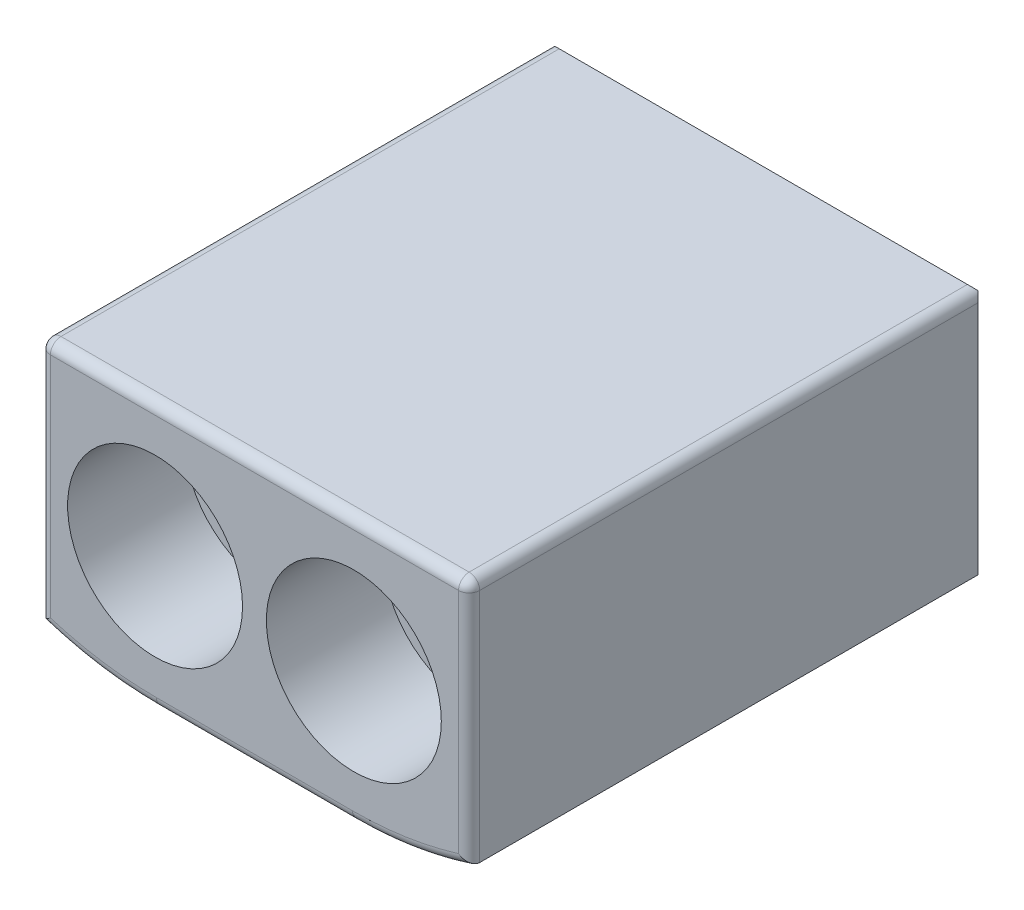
ISO-10303-21;
HEADER;
FILE_DESCRIPTION(('STEP AP214'),'2;1');
FILE_NAME('part.step','',(''),(''),'','','');
FILE_SCHEMA(('AUTOMOTIVE_DESIGN { 1 0 10303 214 1 1 1 1 }'));
ENDSEC;
DATA;
#1=APPLICATION_CONTEXT('core data for automotive mechanical design processes');
#2=APPLICATION_PROTOCOL_DEFINITION('international standard','automotive_design',2000,#1);
#3=PRODUCT_CONTEXT('',#1,'mechanical');
#4=PRODUCT('Part','Part','',(#3));
#5=PRODUCT_RELATED_PRODUCT_CATEGORY('part','',(#4));
#6=PRODUCT_DEFINITION_FORMATION('','',#4);
#7=PRODUCT_DEFINITION_CONTEXT('part definition',#1,'design');
#8=PRODUCT_DEFINITION('design','',#6,#7);
#9=PRODUCT_DEFINITION_SHAPE('','',#8);
#10=(LENGTH_UNIT() NAMED_UNIT(*) SI_UNIT(.MILLI.,.METRE.));
#11=(NAMED_UNIT(*) PLANE_ANGLE_UNIT() SI_UNIT($,.RADIAN.));
#12=(NAMED_UNIT(*) SI_UNIT($,.STERADIAN.) SOLID_ANGLE_UNIT());
#13=UNCERTAINTY_MEASURE_WITH_UNIT(LENGTH_MEASURE(1.E-05),#10,'distance_accuracy_value','');
#14=(GEOMETRIC_REPRESENTATION_CONTEXT(3) GLOBAL_UNCERTAINTY_ASSIGNED_CONTEXT((#13)) GLOBAL_UNIT_ASSIGNED_CONTEXT((#10,
#11,#12)) REPRESENTATION_CONTEXT('',''));
#15=CARTESIAN_POINT('',(0.,0.,0.));
#16=DIRECTION('',(0.,0.,1.));
#17=DIRECTION('',(1.,0.,0.));
#18=AXIS2_PLACEMENT_3D('',#15,#16,#17);
#19=CARTESIAN_POINT('',(-4.7625,-6.35,-25.4));
#20=DIRECTION('',(0.,0.,1.));
#21=DIRECTION('',(1.,0.,0.));
#22=AXIS2_PLACEMENT_3D('',#19,#20,#21);
#23=CYLINDRICAL_SURFACE('',#22,2.794);
#24=CARTESIAN_POINT('',(-4.7625,-6.35,-25.4));
#25=DIRECTION('',(0.,0.,1.));
#26=DIRECTION('',(1.,0.,0.));
#27=AXIS2_PLACEMENT_3D('',#24,#25,#26);
#28=CIRCLE('',#27,2.794);
#29=CARTESIAN_POINT('',(-1.9685,-6.35,-25.4));
#30=VERTEX_POINT('',#29);
#31=EDGE_CURVE('E387',#30,#30,#28,.T.);
#32=ORIENTED_EDGE('',*,*,#31,.F.);
#33=EDGE_LOOP('',(#32));
#34=FACE_BOUND('',#33,.T.);
#35=CARTESIAN_POINT('',(-4.7625,-6.35,-5.588));
#36=DIRECTION('',(0.,0.,1.));
#37=DIRECTION('',(1.,0.,0.));
#38=AXIS2_PLACEMENT_3D('',#35,#36,#37);
#39=CIRCLE('',#38,2.794);
#40=CARTESIAN_POINT('',(-1.9685,-6.35,-5.588));
#41=VERTEX_POINT('',#40);
#42=EDGE_CURVE('E195',#41,#41,#39,.F.);
#43=ORIENTED_EDGE('',*,*,#42,.F.);
#44=EDGE_LOOP('',(#43));
#45=FACE_BOUND('',#44,.T.);
#46=ADVANCED_FACE('F37',(#34,#45),#23,.F.);
#47=CARTESIAN_POINT('',(4.7625,-6.35,-25.4));
#48=DIRECTION('',(0.,0.,1.));
#49=DIRECTION('',(1.,0.,0.));
#50=AXIS2_PLACEMENT_3D('',#47,#48,#49);
#51=CYLINDRICAL_SURFACE('',#50,2.794);
#52=CARTESIAN_POINT('',(4.7625,-6.35,-25.4));
#53=DIRECTION('',(0.,0.,1.));
#54=DIRECTION('',(1.,0.,0.));
#55=AXIS2_PLACEMENT_3D('',#52,#53,#54);
#56=CIRCLE('',#55,2.794);
#57=CARTESIAN_POINT('',(7.5565,-6.35,-25.4));
#58=VERTEX_POINT('',#57);
#59=EDGE_CURVE('E384',#58,#58,#56,.T.);
#60=ORIENTED_EDGE('',*,*,#59,.F.);
#61=EDGE_LOOP('',(#60));
#62=FACE_BOUND('',#61,.T.);
#63=CARTESIAN_POINT('',(4.7625,-6.35,-5.588));
#64=DIRECTION('',(0.,0.,1.));
#65=DIRECTION('',(1.,0.,0.));
#66=AXIS2_PLACEMENT_3D('',#63,#64,#65);
#67=CIRCLE('',#66,2.794);
#68=CARTESIAN_POINT('',(7.5565,-6.35,-5.588));
#69=VERTEX_POINT('',#68);
#70=EDGE_CURVE('E385',#69,#69,#67,.F.);
#71=ORIENTED_EDGE('',*,*,#70,.F.);
#72=EDGE_LOOP('',(#71));
#73=FACE_BOUND('',#72,.T.);
#74=ADVANCED_FACE('F407',(#62,#73),#51,.F.);
#75=CARTESIAN_POINT('',(-4.699,5.08,-25.4));
#76=DIRECTION('',(0.,0.,1.));
#77=DIRECTION('',(1.,0.,0.));
#78=AXIS2_PLACEMENT_3D('',#75,#76,#77);
#79=CYLINDRICAL_SURFACE('',#78,17.78);
#80=DIRECTION('',(0.,0.,1.));
#81=VECTOR('',#80,1.);
#82=CARTESIAN_POINT('',(-4.699,-12.7,-25.4));
#83=LINE('',#82,#81);
#84=CARTESIAN_POINT('',(-4.699,-12.7,-24.384));
#85=VERTEX_POINT('',#84);
#86=CARTESIAN_POINT('',(-4.699,-12.7,-0.508000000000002));
#87=VERTEX_POINT('',#86);
#88=EDGE_CURVE('E155',#85,#87,#83,.T.);
#89=ORIENTED_EDGE('',*,*,#88,.T.);
#90=CARTESIAN_POINT('',(-4.699,5.08,-0.508000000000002));
#91=DIRECTION('',(0.,0.,-1.));
#92=DIRECTION('',(-1.,0.,0.));
#93=AXIS2_PLACEMENT_3D('',#90,#91,#92);
#94=CIRCLE('',#93,17.78);
#95=CARTESIAN_POINT('',(-10.287,-11.7990596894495,-0.508000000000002));
#96=VERTEX_POINT('',#95);
#97=EDGE_CURVE('E265',#87,#96,#94,.T.);
#98=ORIENTED_EDGE('',*,*,#97,.T.);
#99=DIRECTION('',(0.,0.,1.));
#100=VECTOR('',#99,1.);
#101=CARTESIAN_POINT('',(-10.287,-11.7990596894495,-25.4));
#102=LINE('',#101,#100);
#103=CARTESIAN_POINT('',(-10.287,-11.7990596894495,-24.384));
#104=VERTEX_POINT('',#103);
#105=EDGE_CURVE('E188',#104,#96,#102,.T.);
#106=ORIENTED_EDGE('',*,*,#105,.F.);
#107=CARTESIAN_POINT('',(-4.699,5.08,-24.384));
#108=DIRECTION('',(0.,0.,-1.));
#109=DIRECTION('',(-1.,0.,0.));
#110=AXIS2_PLACEMENT_3D('',#107,#108,#109);
#111=CIRCLE('',#110,17.78);
#112=EDGE_CURVE('E207',#104,#85,#111,.F.);
#113=ORIENTED_EDGE('',*,*,#112,.T.);
#114=EDGE_LOOP('',(#89,#98,#106,#113));
#115=FACE_BOUND('',#114,.T.);
#116=ADVANCED_FACE('F410',(#115),#79,.T.);
#117=CARTESIAN_POINT('',(-10.287,-11.7990596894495,-25.4));
#118=DIRECTION('',(-1.,0.,0.));
#119=DIRECTION('',(0.,0.,1.));
#120=AXIS2_PLACEMENT_3D('',#117,#118,#119);
#121=PLANE('',#120);
#122=ORIENTED_EDGE('',*,*,#105,.T.);
#123=DIRECTION('',(0.,-1.,0.));
#124=VECTOR('',#123,1.);
#125=CARTESIAN_POINT('',(-10.287,0.,-0.508));
#126=LINE('',#125,#124);
#127=CARTESIAN_POINT('',(-10.287,-0.508,-0.508));
#128=VERTEX_POINT('',#127);
#129=EDGE_CURVE('E271',#96,#128,#126,.F.);
#130=ORIENTED_EDGE('',*,*,#129,.T.);
#131=DIRECTION('',(0.,0.,1.));
#132=VECTOR('',#131,1.);
#133=CARTESIAN_POINT('',(-10.287,-0.508,-25.4));
#134=LINE('',#133,#132);
#135=CARTESIAN_POINT('',(-10.287,-0.508,-24.384));
#136=VERTEX_POINT('',#135);
#137=EDGE_CURVE('E269',#128,#136,#134,.F.);
#138=ORIENTED_EDGE('',*,*,#137,.T.);
#139=DIRECTION('',(0.,-1.,0.));
#140=VECTOR('',#139,1.);
#141=CARTESIAN_POINT('',(-10.287,-11.7990596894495,-24.384));
#142=LINE('',#141,#140);
#143=EDGE_CURVE('E209',#136,#104,#142,.T.);
#144=ORIENTED_EDGE('',*,*,#143,.T.);
#145=EDGE_LOOP('',(#122,#130,#138,#144));
#146=FACE_BOUND('',#145,.T.);
#147=ADVANCED_FACE('F416',(#146),#121,.T.);
#148=CARTESIAN_POINT('',(-10.287,0.,-25.4));
#149=DIRECTION('',(0.,1.,0.));
#150=DIRECTION('',(-1.,0.,0.));
#151=AXIS2_PLACEMENT_3D('',#148,#149,#150);
#152=PLANE('',#151);
#153=DIRECTION('',(-1.,0.,0.));
#154=VECTOR('',#153,1.);
#155=CARTESIAN_POINT('',(10.287,0.,-0.508));
#156=LINE('',#155,#154);
#157=CARTESIAN_POINT('',(-9.779,0.,-0.508));
#158=VERTEX_POINT('',#157);
#159=CARTESIAN_POINT('',(9.779,0.,-0.508));
#160=VERTEX_POINT('',#159);
#161=EDGE_CURVE('E279',#158,#160,#156,.F.);
#162=ORIENTED_EDGE('',*,*,#161,.T.);
#163=DIRECTION('',(0.,0.,1.));
#164=VECTOR('',#163,1.);
#165=CARTESIAN_POINT('',(9.779,0.,-25.4));
#166=LINE('',#165,#164);
#167=CARTESIAN_POINT('',(9.779,0.,-24.384));
#168=VERTEX_POINT('',#167);
#169=EDGE_CURVE('E283',#160,#168,#166,.F.);
#170=ORIENTED_EDGE('',*,*,#169,.T.);
#171=DIRECTION('',(-1.,0.,0.));
#172=VECTOR('',#171,1.);
#173=CARTESIAN_POINT('',(-10.287,0.,-24.384));
#174=LINE('',#173,#172);
#175=CARTESIAN_POINT('',(-9.779,0.,-24.384));
#176=VERTEX_POINT('',#175);
#177=EDGE_CURVE('E211',#168,#176,#174,.T.);
#178=ORIENTED_EDGE('',*,*,#177,.T.);
#179=DIRECTION('',(0.,0.,1.));
#180=VECTOR('',#179,1.);
#181=CARTESIAN_POINT('',(-9.779,0.,-25.4));
#182=LINE('',#181,#180);
#183=EDGE_CURVE('E281',#176,#158,#182,.T.);
#184=ORIENTED_EDGE('',*,*,#183,.T.);
#185=EDGE_LOOP('',(#162,#170,#178,#184));
#186=FACE_BOUND('',#185,.T.);
#187=ADVANCED_FACE('F354',(#186),#152,.T.);
#188=CARTESIAN_POINT('',(10.287,-11.7990596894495,-25.4));
#189=DIRECTION('',(1.,0.,0.));
#190=DIRECTION('',(0.,1.,0.));
#191=AXIS2_PLACEMENT_3D('',#188,#189,#190);
#192=PLANE('',#191);
#193=DIRECTION('',(0.,1.,0.));
#194=VECTOR('',#193,1.);
#195=CARTESIAN_POINT('',(10.287,-11.7990596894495,-24.384));
#196=LINE('',#195,#194);
#197=CARTESIAN_POINT('',(10.287,-11.7990596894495,-24.384));
#198=VERTEX_POINT('',#197);
#199=CARTESIAN_POINT('',(10.287,-0.507999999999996,-24.384));
#200=VERTEX_POINT('',#199);
#201=EDGE_CURVE('E160',#198,#200,#196,.T.);
#202=ORIENTED_EDGE('',*,*,#201,.T.);
#203=DIRECTION('',(0.,0.,1.));
#204=VECTOR('',#203,1.);
#205=CARTESIAN_POINT('',(10.287,-0.507999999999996,-25.4));
#206=LINE('',#205,#204);
#207=CARTESIAN_POINT('',(10.287,-0.507999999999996,-0.508));
#208=VERTEX_POINT('',#207);
#209=EDGE_CURVE('E277',#200,#208,#206,.T.);
#210=ORIENTED_EDGE('',*,*,#209,.T.);
#211=DIRECTION('',(0.,1.,0.));
#212=VECTOR('',#211,1.);
#213=CARTESIAN_POINT('',(10.287,-11.7990596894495,-0.508));
#214=LINE('',#213,#212);
#215=CARTESIAN_POINT('',(10.287,-11.7990596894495,-0.508000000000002));
#216=VERTEX_POINT('',#215);
#217=EDGE_CURVE('E275',#208,#216,#214,.F.);
#218=ORIENTED_EDGE('',*,*,#217,.T.);
#219=DIRECTION('',(0.,0.,1.));
#220=VECTOR('',#219,1.);
#221=CARTESIAN_POINT('',(10.287,-11.7990596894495,-25.4));
#222=LINE('',#221,#220);
#223=EDGE_CURVE('E172',#198,#216,#222,.T.);
#224=ORIENTED_EDGE('',*,*,#223,.F.);
#225=EDGE_LOOP('',(#202,#210,#218,#224));
#226=FACE_BOUND('',#225,.T.);
#227=ADVANCED_FACE('F380',(#226),#192,.T.);
#228=CARTESIAN_POINT('',(4.69899999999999,5.08,-25.4));
#229=DIRECTION('',(0.,0.,1.));
#230=DIRECTION('',(1.,0.,0.));
#231=AXIS2_PLACEMENT_3D('',#228,#229,#230);
#232=CYLINDRICAL_SURFACE('',#231,17.78);
#233=ORIENTED_EDGE('',*,*,#223,.T.);
#234=CARTESIAN_POINT('',(4.69899999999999,5.08,-0.508000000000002));
#235=DIRECTION('',(0.,0.,-1.));
#236=DIRECTION('',(-1.,0.,0.));
#237=AXIS2_PLACEMENT_3D('',#234,#235,#236);
#238=CIRCLE('',#237,17.78);
#239=CARTESIAN_POINT('',(4.69899999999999,-12.7,-0.508000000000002));
#240=VERTEX_POINT('',#239);
#241=EDGE_CURVE('E171',#216,#240,#238,.T.);
#242=ORIENTED_EDGE('',*,*,#241,.T.);
#243=DIRECTION('',(0.,0.,1.));
#244=VECTOR('',#243,1.);
#245=CARTESIAN_POINT('',(4.69899999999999,-12.7,-25.4));
#246=LINE('',#245,#244);
#247=CARTESIAN_POINT('',(4.69899999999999,-12.7,-24.384));
#248=VERTEX_POINT('',#247);
#249=EDGE_CURVE('E152',#248,#240,#246,.T.);
#250=ORIENTED_EDGE('',*,*,#249,.F.);
#251=CARTESIAN_POINT('',(4.69899999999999,5.08,-24.384));
#252=DIRECTION('',(0.,0.,-1.));
#253=DIRECTION('',(-1.,0.,0.));
#254=AXIS2_PLACEMENT_3D('',#251,#252,#253);
#255=CIRCLE('',#254,17.78);
#256=EDGE_CURVE('E168',#248,#198,#255,.F.);
#257=ORIENTED_EDGE('',*,*,#256,.T.);
#258=EDGE_LOOP('',(#233,#242,#250,#257));
#259=FACE_BOUND('',#258,.T.);
#260=ADVANCED_FACE('F166',(#259),#232,.T.);
#261=CARTESIAN_POINT('',(-4.699,-12.7,-25.4));
#262=DIRECTION('',(0.,-1.,0.));
#263=DIRECTION('',(1.,0.,0.));
#264=AXIS2_PLACEMENT_3D('',#261,#262,#263);
#265=PLANE('',#264);
#266=ORIENTED_EDGE('',*,*,#249,.T.);
#267=DIRECTION('',(1.,0.,0.));
#268=VECTOR('',#267,1.);
#269=CARTESIAN_POINT('',(-4.699,-12.7,-0.508));
#270=LINE('',#269,#268);
#271=EDGE_CURVE('E273',#240,#87,#270,.F.);
#272=ORIENTED_EDGE('',*,*,#271,.T.);
#273=ORIENTED_EDGE('',*,*,#88,.F.);
#274=DIRECTION('',(1.,0.,0.));
#275=VECTOR('',#274,1.);
#276=CARTESIAN_POINT('',(-4.699,-12.7,-24.384));
#277=LINE('',#276,#275);
#278=EDGE_CURVE('E149',#85,#248,#277,.T.);
#279=ORIENTED_EDGE('',*,*,#278,.T.);
#280=EDGE_LOOP('',(#266,#272,#273,#279));
#281=FACE_BOUND('',#280,.T.);
#282=ADVANCED_FACE('F151',(#281),#265,.T.);
#283=CARTESIAN_POINT('',(-4.699,5.08,-25.4));
#284=DIRECTION('',(0.,0.,-1.));
#285=DIRECTION('',(-1.,0.,0.));
#286=AXIS2_PLACEMENT_3D('',#283,#284,#285);
#287=PLANE('',#286);
#288=DIRECTION('',(0.,-1.,0.));
#289=VECTOR('',#288,1.);
#290=CARTESIAN_POINT('',(9.27099999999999,5.08,-25.4));
#291=LINE('',#290,#289);
#292=CARTESIAN_POINT('',(9.271,-1.016,-25.4));
#293=VERTEX_POINT('',#292);
#294=CARTESIAN_POINT('',(9.271,-11.0484999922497,-25.4));
#295=VERTEX_POINT('',#294);
#296=EDGE_CURVE('E201',#293,#295,#291,.T.);
#297=ORIENTED_EDGE('',*,*,#296,.T.);
#298=CARTESIAN_POINT('',(4.69899999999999,5.08,-25.4));
#299=DIRECTION('',(0.,0.,-1.));
#300=DIRECTION('',(-1.,0.,0.));
#301=AXIS2_PLACEMENT_3D('',#298,#299,#300);
#302=CIRCLE('',#301,16.764);
#303=CARTESIAN_POINT('',(4.69899999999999,-11.684,-25.4));
#304=VERTEX_POINT('',#303);
#305=EDGE_CURVE('E161',#295,#304,#302,.T.);
#306=ORIENTED_EDGE('',*,*,#305,.T.);
#307=DIRECTION('',(-1.,0.,0.));
#308=VECTOR('',#307,1.);
#309=CARTESIAN_POINT('',(-4.699,-11.684,-25.4));
#310=LINE('',#309,#308);
#311=CARTESIAN_POINT('',(-4.699,-11.684,-25.4));
#312=VERTEX_POINT('',#311);
#313=EDGE_CURVE('E177',#304,#312,#310,.T.);
#314=ORIENTED_EDGE('',*,*,#313,.T.);
#315=CARTESIAN_POINT('',(-4.699,5.08,-25.4));
#316=DIRECTION('',(0.,0.,-1.));
#317=DIRECTION('',(-1.,0.,0.));
#318=AXIS2_PLACEMENT_3D('',#315,#316,#317);
#319=CIRCLE('',#318,16.764);
#320=CARTESIAN_POINT('',(-9.271,-11.0484999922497,-25.4));
#321=VERTEX_POINT('',#320);
#322=EDGE_CURVE('E199',#312,#321,#319,.T.);
#323=ORIENTED_EDGE('',*,*,#322,.T.);
#324=DIRECTION('',(0.,1.,0.));
#325=VECTOR('',#324,1.);
#326=CARTESIAN_POINT('',(-9.271,5.08,-25.4));
#327=LINE('',#326,#325);
#328=CARTESIAN_POINT('',(-9.271,-1.016,-25.4));
#329=VERTEX_POINT('',#328);
#330=EDGE_CURVE('E190',#321,#329,#327,.T.);
#331=ORIENTED_EDGE('',*,*,#330,.T.);
#332=DIRECTION('',(1.,0.,0.));
#333=VECTOR('',#332,1.);
#334=CARTESIAN_POINT('',(-4.699,-1.016,-25.4));
#335=LINE('',#334,#333);
#336=EDGE_CURVE('E187',#329,#293,#335,.T.);
#337=ORIENTED_EDGE('',*,*,#336,.T.);
#338=EDGE_LOOP('',(#297,#306,#314,#323,#331,#337));
#339=FACE_BOUND('',#338,.T.);
#340=ORIENTED_EDGE('',*,*,#31,.T.);
#341=EDGE_LOOP('',(#340));
#342=FACE_BOUND('',#341,.T.);
#343=ORIENTED_EDGE('',*,*,#59,.T.);
#344=EDGE_LOOP('',(#343));
#345=FACE_BOUND('',#344,.T.);
#346=ADVANCED_FACE('F405',(#339,#342,#345),#287,.T.);
#347=CARTESIAN_POINT('',(-4.699,5.08,0.));
#348=DIRECTION('',(0.,0.,-1.));
#349=DIRECTION('',(-1.,0.,0.));
#350=AXIS2_PLACEMENT_3D('',#347,#348,#349);
#351=PLANE('',#350);
#352=CARTESIAN_POINT('',(-4.699,5.08,0.));
#353=DIRECTION('',(0.,0.,-1.));
#354=DIRECTION('',(-1.,0.,0.));
#355=AXIS2_PLACEMENT_3D('',#352,#353,#354);
#356=CIRCLE('',#355,17.272);
#357=CARTESIAN_POINT('',(-9.779,-11.4280460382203,0.));
#358=VERTEX_POINT('',#357);
#359=CARTESIAN_POINT('',(-4.699,-12.192,0.));
#360=VERTEX_POINT('',#359);
#361=EDGE_CURVE('E260',#358,#360,#356,.F.);
#362=ORIENTED_EDGE('',*,*,#361,.T.);
#363=DIRECTION('',(1.,0.,0.));
#364=VECTOR('',#363,1.);
#365=CARTESIAN_POINT('',(4.69899999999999,-12.192,0.));
#366=LINE('',#365,#364);
#367=CARTESIAN_POINT('',(4.69899999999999,-12.192,0.));
#368=VERTEX_POINT('',#367);
#369=EDGE_CURVE('E263',#360,#368,#366,.T.);
#370=ORIENTED_EDGE('',*,*,#369,.T.);
#371=CARTESIAN_POINT('',(4.69899999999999,5.08,0.));
#372=DIRECTION('',(0.,0.,-1.));
#373=DIRECTION('',(-1.,0.,0.));
#374=AXIS2_PLACEMENT_3D('',#371,#372,#373);
#375=CIRCLE('',#374,17.272);
#376=CARTESIAN_POINT('',(9.779,-11.4280460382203,0.));
#377=VERTEX_POINT('',#376);
#378=EDGE_CURVE('E258',#368,#377,#375,.F.);
#379=ORIENTED_EDGE('',*,*,#378,.T.);
#380=DIRECTION('',(0.,1.,0.));
#381=VECTOR('',#380,1.);
#382=CARTESIAN_POINT('',(9.779,0.,0.));
#383=LINE('',#382,#381);
#384=CARTESIAN_POINT('',(9.779,-0.507999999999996,0.));
#385=VERTEX_POINT('',#384);
#386=EDGE_CURVE('E254',#377,#385,#383,.T.);
#387=ORIENTED_EDGE('',*,*,#386,.T.);
#388=DIRECTION('',(-1.,0.,0.));
#389=VECTOR('',#388,1.);
#390=CARTESIAN_POINT('',(-10.287,-0.508,0.));
#391=LINE('',#390,#389);
#392=CARTESIAN_POINT('',(-9.779,-0.508,0.));
#393=VERTEX_POINT('',#392);
#394=EDGE_CURVE('E214',#385,#393,#391,.T.);
#395=ORIENTED_EDGE('',*,*,#394,.T.);
#396=DIRECTION('',(0.,-1.,0.));
#397=VECTOR('',#396,1.);
#398=CARTESIAN_POINT('',(-9.779,-11.7990596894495,0.));
#399=LINE('',#398,#397);
#400=EDGE_CURVE('E256',#393,#358,#399,.T.);
#401=ORIENTED_EDGE('',*,*,#400,.T.);
#402=EDGE_LOOP('',(#362,#370,#379,#387,#395,#401));
#403=FACE_BOUND('',#402,.T.);
#404=CARTESIAN_POINT('',(-4.7625,-6.35,0.));
#405=DIRECTION('',(0.,0.,1.));
#406=DIRECTION('',(1.,0.,0.));
#407=AXIS2_PLACEMENT_3D('',#404,#405,#406);
#408=CIRCLE('',#407,4.191);
#409=CARTESIAN_POINT('',(-0.571499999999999,-6.35,0.));
#410=VERTEX_POINT('',#409);
#411=EDGE_CURVE('E250',#410,#410,#408,.T.);
#412=ORIENTED_EDGE('',*,*,#411,.F.);
#413=EDGE_LOOP('',(#412));
#414=FACE_BOUND('',#413,.T.);
#415=CARTESIAN_POINT('',(4.7625,-6.35,0.));
#416=DIRECTION('',(0.,0.,1.));
#417=DIRECTION('',(1.,0.,0.));
#418=AXIS2_PLACEMENT_3D('',#415,#416,#417);
#419=CIRCLE('',#418,4.191);
#420=CARTESIAN_POINT('',(8.9535,-6.35,0.));
#421=VERTEX_POINT('',#420);
#422=EDGE_CURVE('E394',#421,#421,#419,.T.);
#423=ORIENTED_EDGE('',*,*,#422,.F.);
#424=EDGE_LOOP('',(#423));
#425=FACE_BOUND('',#424,.T.);
#426=ADVANCED_FACE('F373',(#403,#414,#425),#351,.F.);
#427=CARTESIAN_POINT('',(4.7625,-6.35,-5.588));
#428=DIRECTION('',(0.,0.,1.));
#429=DIRECTION('',(1.,0.,0.));
#430=AXIS2_PLACEMENT_3D('',#427,#428,#429);
#431=PLANE('',#430);
#432=CARTESIAN_POINT('',(4.7625,-6.35,-5.588));
#433=DIRECTION('',(0.,0.,1.));
#434=DIRECTION('',(1.,0.,0.));
#435=AXIS2_PLACEMENT_3D('',#432,#433,#434);
#436=CIRCLE('',#435,4.191);
#437=CARTESIAN_POINT('',(8.9535,-6.35,-5.588));
#438=VERTEX_POINT('',#437);
#439=EDGE_CURVE('E388',#438,#438,#436,.T.);
#440=ORIENTED_EDGE('',*,*,#439,.T.);
#441=EDGE_LOOP('',(#440));
#442=FACE_BOUND('',#441,.T.);
#443=ORIENTED_EDGE('',*,*,#70,.T.);
#444=EDGE_LOOP('',(#443));
#445=FACE_BOUND('',#444,.T.);
#446=ADVANCED_FACE('F427',(#442,#445),#431,.T.);
#447=CARTESIAN_POINT('',(4.7625,-6.35,-5.588));
#448=DIRECTION('',(0.,0.,1.));
#449=DIRECTION('',(1.,0.,0.));
#450=AXIS2_PLACEMENT_3D('',#447,#448,#449);
#451=CYLINDRICAL_SURFACE('',#450,4.191);
#452=ORIENTED_EDGE('',*,*,#439,.F.);
#453=EDGE_LOOP('',(#452));
#454=FACE_BOUND('',#453,.T.);
#455=ORIENTED_EDGE('',*,*,#422,.T.);
#456=EDGE_LOOP('',(#455));
#457=FACE_BOUND('',#456,.T.);
#458=ADVANCED_FACE('F459',(#454,#457),#451,.F.);
#459=CARTESIAN_POINT('',(-4.7625,-6.35,-5.588));
#460=DIRECTION('',(0.,0.,1.));
#461=DIRECTION('',(1.,0.,0.));
#462=AXIS2_PLACEMENT_3D('',#459,#460,#461);
#463=PLANE('',#462);
#464=CARTESIAN_POINT('',(-4.7625,-6.35,-5.588));
#465=DIRECTION('',(0.,0.,1.));
#466=DIRECTION('',(1.,0.,0.));
#467=AXIS2_PLACEMENT_3D('',#464,#465,#466);
#468=CIRCLE('',#467,4.191);
#469=CARTESIAN_POINT('',(-0.571499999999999,-6.35,-5.588));
#470=VERTEX_POINT('',#469);
#471=EDGE_CURVE('E719',#470,#470,#468,.T.);
#472=ORIENTED_EDGE('',*,*,#471,.T.);
#473=EDGE_LOOP('',(#472));
#474=FACE_BOUND('',#473,.T.);
#475=ORIENTED_EDGE('',*,*,#42,.T.);
#476=EDGE_LOOP('',(#475));
#477=FACE_BOUND('',#476,.T.);
#478=ADVANCED_FACE('F466',(#474,#477),#463,.T.);
#479=CARTESIAN_POINT('',(-4.7625,-6.35,-5.588));
#480=DIRECTION('',(0.,0.,1.));
#481=DIRECTION('',(1.,0.,0.));
#482=AXIS2_PLACEMENT_3D('',#479,#480,#481);
#483=CYLINDRICAL_SURFACE('',#482,4.191);
#484=ORIENTED_EDGE('',*,*,#471,.F.);
#485=EDGE_LOOP('',(#484));
#486=FACE_BOUND('',#485,.T.);
#487=ORIENTED_EDGE('',*,*,#411,.T.);
#488=EDGE_LOOP('',(#487));
#489=FACE_BOUND('',#488,.T.);
#490=ADVANCED_FACE('F238',(#486,#489),#483,.F.);
#491=CARTESIAN_POINT('',(-10.287,-11.7990596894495,-24.384));
#492=DIRECTION('',(0.707106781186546,0.,0.707106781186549));
#493=DIRECTION('',(0.707106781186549,0.,-0.707106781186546));
#494=AXIS2_PLACEMENT_3D('',#491,#492,#493);
#495=PLANE('',#494);
#496=ORIENTED_EDGE('',*,*,#143,.F.);
#497=CARTESIAN_POINT('',(-9.779,-0.508,-24.892));
#498=DIRECTION('',(0.707106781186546,0.,0.707106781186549));
#499=DIRECTION('',(-0.707106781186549,0.,0.707106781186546));
#500=AXIS2_PLACEMENT_3D('',#497,#498,#499);
#501=ELLIPSE('',#500,0.718420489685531,0.508);
#502=CARTESIAN_POINT('',(-10.1382102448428,-0.148789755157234,-24.5327897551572));
#503=VERTEX_POINT('',#502);
#504=EDGE_CURVE('E11',#136,#503,#501,.F.);
#505=ORIENTED_EDGE('',*,*,#504,.T.);
#506=DIRECTION('',(-0.577350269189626,0.577350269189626,0.577350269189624));
#507=VECTOR('',#506,1.);
#508=CARTESIAN_POINT('',(-10.287,0.,-24.384));
#509=LINE('',#508,#507);
#510=EDGE_CURVE('E251',#329,#503,#509,.T.);
#511=ORIENTED_EDGE('',*,*,#510,.F.);
#512=ORIENTED_EDGE('',*,*,#330,.F.);
#513=CARTESIAN_POINT('',(-9.271,-11.0484999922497,-25.4));
#514=CARTESIAN_POINT('',(-9.43950807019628,-11.1758278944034,-25.2314919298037));
#515=CARTESIAN_POINT('',(-9.60842882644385,-11.3020385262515,-25.0625711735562));
#516=CARTESIAN_POINT('',(-9.9470954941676,-11.5522250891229,-24.7239045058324));
#517=CARTESIAN_POINT('',(-10.1168414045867,-11.6762010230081,-24.5541585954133));
#518=CARTESIAN_POINT('',(-10.287,-11.7990596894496,-24.384));
#519=B_SPLINE_CURVE_WITH_KNOTS('',3,(#513,#514,#515,#516,#517,#518),.UNSPECIFIED.,.F.,.F.,(4,2,
4),(0.,0.810541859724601,1.62108268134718),.UNSPECIFIED.);
#520=EDGE_CURVE('E242',#104,#321,#519,.F.);
#521=ORIENTED_EDGE('',*,*,#520,.F.);
#522=EDGE_LOOP('',(#496,#505,#511,#512,#521));
#523=FACE_BOUND('',#522,.T.);
#524=ADVANCED_FACE('F234',(#523),#495,.F.);
#525=CARTESIAN_POINT('',(-4.699,5.08,-24.384));
#526=DIRECTION('',(0.,0.,1.));
#527=DIRECTION('',(1.,0.,0.));
#528=AXIS2_PLACEMENT_3D('',#525,#526,#527);
#529=CONICAL_SURFACE('',#528,17.78,0.78539816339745);
#530=ORIENTED_EDGE('',*,*,#520,.T.);
#531=ORIENTED_EDGE('',*,*,#322,.F.);
#532=DIRECTION('',(0.,0.707106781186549,-0.707106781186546));
#533=VECTOR('',#532,1.);
#534=CARTESIAN_POINT('',(-4.699,-12.7,-24.384));
#535=LINE('',#534,#533);
#536=EDGE_CURVE('E702',#85,#312,#535,.T.);
#537=ORIENTED_EDGE('',*,*,#536,.F.);
#538=ORIENTED_EDGE('',*,*,#112,.F.);
#539=EDGE_LOOP('',(#530,#531,#537,#538));
#540=FACE_BOUND('',#539,.T.);
#541=ADVANCED_FACE('F233',(#540),#529,.T.);
#542=CARTESIAN_POINT('',(-10.287,0.,-24.384));
#543=DIRECTION('',(0.,-0.707106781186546,0.707106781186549));
#544=DIRECTION('',(0.,-0.707106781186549,-0.707106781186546));
#545=AXIS2_PLACEMENT_3D('',#542,#543,#544);
#546=PLANE('',#545);
#547=ORIENTED_EDGE('',*,*,#177,.F.);
#548=CARTESIAN_POINT('',(9.779,-0.507999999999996,-24.892));
#549=DIRECTION('',(0.,-0.707106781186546,0.707106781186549));
#550=DIRECTION('',(0.,0.707106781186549,0.707106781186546));
#551=AXIS2_PLACEMENT_3D('',#548,#549,#550);
#552=ELLIPSE('',#551,0.718420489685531,0.508);
#553=CARTESIAN_POINT('',(10.1382102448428,-0.148789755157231,-24.5327897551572));
#554=VERTEX_POINT('',#553);
#555=EDGE_CURVE('E54',#168,#554,#552,.F.);
#556=ORIENTED_EDGE('',*,*,#555,.T.);
#557=DIRECTION('',(-0.577350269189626,-0.577350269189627,-0.577350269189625));
#558=VECTOR('',#557,1.);
#559=CARTESIAN_POINT('',(3.429,-6.85800000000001,-31.242));
#560=LINE('',#559,#558);
#561=EDGE_CURVE('E181',#293,#554,#560,.F.);
#562=ORIENTED_EDGE('',*,*,#561,.F.);
#563=ORIENTED_EDGE('',*,*,#336,.F.);
#564=ORIENTED_EDGE('',*,*,#510,.T.);
#565=CARTESIAN_POINT('',(-9.779,-0.508,-24.892));
#566=DIRECTION('',(0.,-0.707106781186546,0.707106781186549));
#567=DIRECTION('',(0.,0.707106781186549,0.707106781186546));
#568=AXIS2_PLACEMENT_3D('',#565,#566,#567);
#569=ELLIPSE('',#568,0.718420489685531,0.508);
#570=EDGE_CURVE('E285',#503,#176,#569,.F.);
#571=ORIENTED_EDGE('',*,*,#570,.T.);
#572=EDGE_LOOP('',(#547,#556,#562,#563,#564,#571));
#573=FACE_BOUND('',#572,.T.);
#574=ADVANCED_FACE('F230',(#573),#546,.F.);
#575=CARTESIAN_POINT('',(-4.699,-12.7,-24.384));
#576=DIRECTION('',(0.,0.707106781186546,0.707106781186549));
#577=DIRECTION('',(0.,-0.707106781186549,0.707106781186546));
#578=AXIS2_PLACEMENT_3D('',#575,#576,#577);
#579=PLANE('',#578);
#580=ORIENTED_EDGE('',*,*,#536,.T.);
#581=ORIENTED_EDGE('',*,*,#313,.F.);
#582=DIRECTION('',(0.,0.707106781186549,-0.707106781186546));
#583=VECTOR('',#582,1.);
#584=CARTESIAN_POINT('',(4.69899999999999,-12.7,-24.384));
#585=LINE('',#584,#583);
#586=EDGE_CURVE('E175',#248,#304,#585,.T.);
#587=ORIENTED_EDGE('',*,*,#586,.F.);
#588=ORIENTED_EDGE('',*,*,#278,.F.);
#589=EDGE_LOOP('',(#580,#581,#587,#588));
#590=FACE_BOUND('',#589,.T.);
#591=ADVANCED_FACE('F176',(#590),#579,.F.);
#592=CARTESIAN_POINT('',(10.287,-11.7990596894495,-24.384));
#593=DIRECTION('',(-0.707106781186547,0.,0.707106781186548));
#594=DIRECTION('',(0.707106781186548,0.,0.707106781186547));
#595=AXIS2_PLACEMENT_3D('',#592,#593,#594);
#596=PLANE('',#595);
#597=ORIENTED_EDGE('',*,*,#561,.T.);
#598=CARTESIAN_POINT('',(9.779,-0.507999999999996,-24.892));
#599=DIRECTION('',(-0.707106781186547,0.,0.707106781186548));
#600=DIRECTION('',(0.707106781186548,0.,0.707106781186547));
#601=AXIS2_PLACEMENT_3D('',#598,#599,#600);
#602=ELLIPSE('',#601,0.718420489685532,0.508);
#603=EDGE_CURVE('E46',#554,#200,#602,.F.);
#604=ORIENTED_EDGE('',*,*,#603,.T.);
#605=ORIENTED_EDGE('',*,*,#201,.F.);
#606=CARTESIAN_POINT('',(10.287,-11.7990596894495,-24.384));
#607=CARTESIAN_POINT('',(10.1168414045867,-11.6762010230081,-24.5541585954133));
#608=CARTESIAN_POINT('',(9.94709549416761,-11.5522250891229,-24.7239045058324));
#609=CARTESIAN_POINT('',(9.60842882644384,-11.3020385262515,-25.0625711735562));
#610=CARTESIAN_POINT('',(9.43950807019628,-11.1758278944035,-25.2314919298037));
#611=CARTESIAN_POINT('',(9.27099999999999,-11.0484999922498,-25.4));
#612=B_SPLINE_CURVE_WITH_KNOTS('',3,(#606,#607,#608,#609,#610,#611),.UNSPECIFIED.,.F.,.F.,(4,2,
4),(0.,0.810540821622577,1.62108268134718),.UNSPECIFIED.);
#613=EDGE_CURVE('E182',#295,#198,#612,.F.);
#614=ORIENTED_EDGE('',*,*,#613,.F.);
#615=ORIENTED_EDGE('',*,*,#296,.F.);
#616=EDGE_LOOP('',(#597,#604,#605,#614,#615));
#617=FACE_BOUND('',#616,.T.);
#618=ADVANCED_FACE('F222',(#617),#596,.F.);
#619=CARTESIAN_POINT('',(4.69899999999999,5.08,-24.384));
#620=DIRECTION('',(0.,0.,1.));
#621=DIRECTION('',(1.,0.,0.));
#622=AXIS2_PLACEMENT_3D('',#619,#620,#621);
#623=CONICAL_SURFACE('',#622,17.78,0.78539816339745);
#624=ORIENTED_EDGE('',*,*,#586,.T.);
#625=ORIENTED_EDGE('',*,*,#305,.F.);
#626=ORIENTED_EDGE('',*,*,#613,.T.);
#627=ORIENTED_EDGE('',*,*,#256,.F.);
#628=EDGE_LOOP('',(#624,#625,#626,#627));
#629=FACE_BOUND('',#628,.T.);
#630=ADVANCED_FACE('F184',(#629),#623,.T.);
#631=CARTESIAN_POINT('',(9.779,-0.507999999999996,-25.4));
#632=DIRECTION('',(0.,0.,1.));
#633=DIRECTION('',(1.,0.,0.));
#634=AXIS2_PLACEMENT_3D('',#631,#632,#633);
#635=CYLINDRICAL_SURFACE('',#634,0.508);
#636=CARTESIAN_POINT('',(9.779,-0.507999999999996,-0.508));
#637=DIRECTION('',(0.,0.,1.));
#638=DIRECTION('',(1.,0.,0.));
#639=AXIS2_PLACEMENT_3D('',#636,#637,#638);
#640=CIRCLE('',#639,0.508);
#641=EDGE_CURVE('E41',#208,#160,#640,.T.);
#642=ORIENTED_EDGE('',*,*,#641,.F.);
#643=ORIENTED_EDGE('',*,*,#209,.F.);
#644=ORIENTED_EDGE('',*,*,#603,.F.);
#645=ORIENTED_EDGE('',*,*,#555,.F.);
#646=ORIENTED_EDGE('',*,*,#169,.F.);
#647=EDGE_LOOP('',(#642,#643,#644,#645,#646));
#648=FACE_BOUND('',#647,.T.);
#649=ADVANCED_FACE('F39',(#648),#635,.T.);
#650=CARTESIAN_POINT('',(9.779,-0.507999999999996,-0.508));
#651=DIRECTION('',(0.,0.,1.));
#652=DIRECTION('',(1.,0.,0.));
#653=AXIS2_PLACEMENT_3D('',#650,#651,#652);
#654=SPHERICAL_SURFACE('',#653,0.508);
#655=CARTESIAN_POINT('',(9.779,-0.507999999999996,-0.508));
#656=DIRECTION('',(0.,1.,0.));
#657=DIRECTION('',(0.,0.,1.));
#658=AXIS2_PLACEMENT_3D('',#655,#656,#657);
#659=CIRCLE('',#658,0.508);
#660=EDGE_CURVE('E335',#208,#385,#659,.F.);
#661=ORIENTED_EDGE('',*,*,#660,.F.);
#662=ORIENTED_EDGE('',*,*,#641,.T.);
#663=CARTESIAN_POINT('',(9.779,-0.507999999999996,-0.508));
#664=DIRECTION('',(1.,0.,0.));
#665=DIRECTION('',(0.,0.,-1.));
#666=AXIS2_PLACEMENT_3D('',#663,#664,#665);
#667=CIRCLE('',#666,0.508);
#668=EDGE_CURVE('E337',#385,#160,#667,.F.);
#669=ORIENTED_EDGE('',*,*,#668,.F.);
#670=EDGE_LOOP('',(#661,#662,#669));
#671=FACE_BOUND('',#670,.T.);
#672=ADVANCED_FACE('F347',(#671),#654,.T.);
#673=CARTESIAN_POINT('',(-9.779,-0.508,-25.4));
#674=DIRECTION('',(0.,0.,1.));
#675=DIRECTION('',(1.,0.,0.));
#676=AXIS2_PLACEMENT_3D('',#673,#674,#675);
#677=CYLINDRICAL_SURFACE('',#676,0.508);
#678=ORIENTED_EDGE('',*,*,#504,.F.);
#679=ORIENTED_EDGE('',*,*,#137,.F.);
#680=CARTESIAN_POINT('',(-9.779,-0.508,-0.508));
#681=DIRECTION('',(0.,0.,1.));
#682=DIRECTION('',(1.,0.,0.));
#683=AXIS2_PLACEMENT_3D('',#680,#681,#682);
#684=CIRCLE('',#683,0.508);
#685=EDGE_CURVE('E332',#158,#128,#684,.T.);
#686=ORIENTED_EDGE('',*,*,#685,.F.);
#687=ORIENTED_EDGE('',*,*,#183,.F.);
#688=ORIENTED_EDGE('',*,*,#570,.F.);
#689=EDGE_LOOP('',(#678,#679,#686,#687,#688));
#690=FACE_BOUND('',#689,.T.);
#691=ADVANCED_FACE('F359',(#690),#677,.T.);
#692=CARTESIAN_POINT('',(-4.699,-0.507999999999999,-0.508));
#693=DIRECTION('',(1.,0.,0.));
#694=DIRECTION('',(0.,1.,0.));
#695=AXIS2_PLACEMENT_3D('',#692,#693,#694);
#696=CYLINDRICAL_SURFACE('',#695,0.508);
#697=ORIENTED_EDGE('',*,*,#668,.T.);
#698=ORIENTED_EDGE('',*,*,#161,.F.);
#699=CARTESIAN_POINT('',(-9.779,-0.508,-0.508));
#700=DIRECTION('',(-1.,0.,0.));
#701=DIRECTION('',(0.,0.,1.));
#702=AXIS2_PLACEMENT_3D('',#699,#700,#701);
#703=CIRCLE('',#702,0.508);
#704=EDGE_CURVE('E328',#393,#158,#703,.T.);
#705=ORIENTED_EDGE('',*,*,#704,.F.);
#706=ORIENTED_EDGE('',*,*,#394,.F.);
#707=EDGE_LOOP('',(#697,#698,#705,#706));
#708=FACE_BOUND('',#707,.T.);
#709=ADVANCED_FACE('F363',(#708),#696,.T.);
#710=CARTESIAN_POINT('',(9.779,5.08,-0.508));
#711=DIRECTION('',(0.,-1.,0.));
#712=DIRECTION('',(1.,0.,0.));
#713=AXIS2_PLACEMENT_3D('',#710,#711,#712);
#714=CYLINDRICAL_SURFACE('',#713,0.508);
#715=ORIENTED_EDGE('',*,*,#660,.T.);
#716=ORIENTED_EDGE('',*,*,#386,.F.);
#717=CARTESIAN_POINT('',(10.287,-11.7990596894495,-0.508000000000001));
#718=CARTESIAN_POINT('',(10.2870360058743,-11.7990851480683,-0.483255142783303));
#719=CARTESIAN_POINT('',(10.2851946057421,-11.7977556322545,-0.458548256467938));
#720=CARTESIAN_POINT('',(10.2780553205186,-11.7925979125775,-0.410045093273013));
#721=CARTESIAN_POINT('',(10.2727770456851,-11.7887838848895,-0.386244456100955));
#722=CARTESIAN_POINT('',(10.2590661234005,-11.7788712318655,-0.340125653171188));
#723=CARTESIAN_POINT('',(10.2506379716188,-11.7727758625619,-0.317805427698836));
#724=CARTESIAN_POINT('',(10.2310554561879,-11.7586031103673,-0.275055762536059));
#725=CARTESIAN_POINT('',(10.219897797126,-11.7505233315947,-0.254628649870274));
#726=CARTESIAN_POINT('',(10.1944922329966,-11.732109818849,-0.214695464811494));
#727=CARTESIAN_POINT('',(10.1800871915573,-11.7216612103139,-0.195343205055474));
#728=CARTESIAN_POINT('',(10.1492310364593,-11.6992557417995,-0.159351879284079));
#729=CARTESIAN_POINT('',(10.1327794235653,-11.6872985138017,-0.142713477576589));
#730=CARTESIAN_POINT('',(10.0951827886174,-11.6599403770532,-0.109464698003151));
#731=CARTESIAN_POINT('',(10.073726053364,-11.6443070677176,-0.0933987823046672));
#732=CARTESIAN_POINT('',(10.0292289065,-11.6118372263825,-0.0651164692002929));
#733=CARTESIAN_POINT('',(10.006186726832,-11.5949993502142,-0.0529044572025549));
#734=CARTESIAN_POINT('',(9.95449265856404,-11.557163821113,-0.0302879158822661));
#735=CARTESIAN_POINT('',(9.92561709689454,-11.5359910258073,-0.0206885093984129));
#736=CARTESIAN_POINT('',(9.86713211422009,-11.4930219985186,-0.00680311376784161));
#737=CARTESIAN_POINT('',(9.83752386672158,-11.4712267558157,-0.00250912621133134));
#738=CARTESIAN_POINT('',(9.79948604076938,-11.4431702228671,-0.000343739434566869));
#739=CARTESIAN_POINT('',(9.79109738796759,-11.4369792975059,-7.47771364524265E-05));
#740=CARTESIAN_POINT('',(9.7814727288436,-11.429872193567,-4.51519341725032E-06));
#741=CARTESIAN_POINT('',(9.78023635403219,-11.4289591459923,-2.20968569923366E-09));
#742=CARTESIAN_POINT('',(9.779,-11.4280460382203,0.));
#743=B_SPLINE_CURVE_WITH_KNOTS('',3,(#717,#718,#719,#720,#721,#722,#723,#724,#725,#726,#727,
#728,#729,#730,#731,#732,#733,#734,#735,#736,#737,#738,#739,#740,#741,#742),.UNSPECIFIED.,.F.,
.F.,(4,2,2,2,2,2,2,2,2,2,2,2,4),(0.,0.0740706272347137,0.147722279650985,0.221269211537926,
0.294905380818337,0.373483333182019,0.452080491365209,0.544829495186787,0.637683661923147,
0.748478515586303,0.859106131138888,0.890389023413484,0.894999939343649),.UNSPECIFIED.);
#744=EDGE_CURVE('E321',#216,#377,#743,.T.);
#745=ORIENTED_EDGE('',*,*,#744,.F.);
#746=ORIENTED_EDGE('',*,*,#217,.F.);
#747=EDGE_LOOP('',(#715,#716,#745,#746));
#748=FACE_BOUND('',#747,.T.);
#749=ADVANCED_FACE('F317',(#748),#714,.T.);
#750=CARTESIAN_POINT('',(-9.779,-0.508,-0.508));
#751=DIRECTION('',(0.,0.,1.));
#752=DIRECTION('',(1.,0.,0.));
#753=AXIS2_PLACEMENT_3D('',#750,#751,#752);
#754=SPHERICAL_SURFACE('',#753,0.508);
#755=ORIENTED_EDGE('',*,*,#704,.T.);
#756=ORIENTED_EDGE('',*,*,#685,.T.);
#757=CARTESIAN_POINT('',(-9.779,-0.508,-0.508));
#758=DIRECTION('',(0.,1.,0.));
#759=DIRECTION('',(0.,0.,1.));
#760=AXIS2_PLACEMENT_3D('',#757,#758,#759);
#761=CIRCLE('',#760,0.508);
#762=EDGE_CURVE('E329',#393,#128,#761,.F.);
#763=ORIENTED_EDGE('',*,*,#762,.F.);
#764=EDGE_LOOP('',(#755,#756,#763));
#765=FACE_BOUND('',#764,.T.);
#766=ADVANCED_FACE('F315',(#765),#754,.T.);
#767=CARTESIAN_POINT('',(4.69899999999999,5.08,-0.508000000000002));
#768=DIRECTION('',(0.,0.,-1.));
#769=DIRECTION('',(-1.,0.,0.));
#770=AXIS2_PLACEMENT_3D('',#767,#768,#769);
#771=TOROIDAL_SURFACE('',#770,17.272,0.508);
#772=ORIENTED_EDGE('',*,*,#744,.T.);
#773=ORIENTED_EDGE('',*,*,#378,.F.);
#774=CARTESIAN_POINT('',(4.69899999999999,-12.192,-0.508000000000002));
#775=DIRECTION('',(-1.,0.,0.));
#776=DIRECTION('',(0.,0.,1.));
#777=AXIS2_PLACEMENT_3D('',#774,#775,#776);
#778=CIRCLE('',#777,0.508);
#779=EDGE_CURVE('E298',#240,#368,#778,.T.);
#780=ORIENTED_EDGE('',*,*,#779,.F.);
#781=ORIENTED_EDGE('',*,*,#241,.F.);
#782=EDGE_LOOP('',(#772,#773,#780,#781));
#783=FACE_BOUND('',#782,.T.);
#784=ADVANCED_FACE('F311',(#783),#771,.T.);
#785=CARTESIAN_POINT('',(-9.779,5.08,-0.508));
#786=DIRECTION('',(0.,1.,0.));
#787=DIRECTION('',(0.,0.,1.));
#788=AXIS2_PLACEMENT_3D('',#785,#786,#787);
#789=CYLINDRICAL_SURFACE('',#788,0.508);
#790=ORIENTED_EDGE('',*,*,#762,.T.);
#791=ORIENTED_EDGE('',*,*,#129,.F.);
#792=CARTESIAN_POINT('',(-10.287,-11.7990596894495,-0.508000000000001));
#793=CARTESIAN_POINT('',(-10.2870360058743,-11.7990851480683,-0.483255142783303));
#794=CARTESIAN_POINT('',(-10.2851946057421,-11.7977556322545,-0.458548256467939));
#795=CARTESIAN_POINT('',(-10.2780553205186,-11.7925979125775,-0.410045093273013));
#796=CARTESIAN_POINT('',(-10.2727770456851,-11.7887838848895,-0.386244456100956));
#797=CARTESIAN_POINT('',(-10.2590661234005,-11.7788712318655,-0.340125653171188));
#798=CARTESIAN_POINT('',(-10.2506379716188,-11.7727758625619,-0.317805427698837));
#799=CARTESIAN_POINT('',(-10.2310554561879,-11.7586031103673,-0.27505576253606));
#800=CARTESIAN_POINT('',(-10.219897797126,-11.7505233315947,-0.254628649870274));
#801=CARTESIAN_POINT('',(-10.1944922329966,-11.732109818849,-0.214695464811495));
#802=CARTESIAN_POINT('',(-10.1800871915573,-11.7216612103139,-0.195343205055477));
#803=CARTESIAN_POINT('',(-10.1492310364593,-11.6992557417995,-0.159351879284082));
#804=CARTESIAN_POINT('',(-10.1327794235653,-11.6872985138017,-0.142713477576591));
#805=CARTESIAN_POINT('',(-10.0951827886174,-11.6599403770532,-0.109464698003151));
#806=CARTESIAN_POINT('',(-10.073726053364,-11.6443070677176,-0.093398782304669));
#807=CARTESIAN_POINT('',(-10.0292289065,-11.6118372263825,-0.0651164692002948));
#808=CARTESIAN_POINT('',(-10.006186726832,-11.5949993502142,-0.0529044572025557));
#809=CARTESIAN_POINT('',(-9.95449265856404,-11.5571638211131,-0.0302879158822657));
#810=CARTESIAN_POINT('',(-9.92561709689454,-11.5359910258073,-0.0206885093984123));
#811=CARTESIAN_POINT('',(-9.86713211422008,-11.4930219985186,-0.0068031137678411));
#812=CARTESIAN_POINT('',(-9.83752386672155,-11.4712267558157,-0.00250912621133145));
#813=CARTESIAN_POINT('',(-9.79948604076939,-11.4431702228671,-0.000343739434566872));
#814=CARTESIAN_POINT('',(-9.79109738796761,-11.4369792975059,-7.47771364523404E-05));
#815=CARTESIAN_POINT('',(-9.78147272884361,-11.429872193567,-4.51519341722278E-06));
#816=CARTESIAN_POINT('',(-9.78023635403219,-11.4289591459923,-2.20968568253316E-09));
#817=CARTESIAN_POINT('',(-9.779,-11.4280460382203,0.));
#818=B_SPLINE_CURVE_WITH_KNOTS('',3,(#792,#793,#794,#795,#796,#797,#798,#799,#800,#801,#802,
#803,#804,#805,#806,#807,#808,#809,#810,#811,#812,#813,#814,#815,#816,#817),.UNSPECIFIED.,.F.,
.F.,(4,2,2,2,2,2,2,2,2,2,2,2,4),(0.,0.0740706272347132,0.147722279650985,0.221269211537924,
0.294905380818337,0.373483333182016,0.452080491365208,0.544829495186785,0.637683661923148,
0.748478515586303,0.85910613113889,0.890389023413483,0.894999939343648),.UNSPECIFIED.);
#819=EDGE_CURVE('E291',#358,#96,#818,.F.);
#820=ORIENTED_EDGE('',*,*,#819,.F.);
#821=ORIENTED_EDGE('',*,*,#400,.F.);
#822=EDGE_LOOP('',(#790,#791,#820,#821));
#823=FACE_BOUND('',#822,.T.);
#824=ADVANCED_FACE('F300',(#823),#789,.T.);
#825=CARTESIAN_POINT('',(-4.699,-12.192,-0.508));
#826=DIRECTION('',(-1.,0.,0.));
#827=DIRECTION('',(0.,-1.,0.));
#828=AXIS2_PLACEMENT_3D('',#825,#826,#827);
#829=CYLINDRICAL_SURFACE('',#828,0.508);
#830=ORIENTED_EDGE('',*,*,#779,.T.);
#831=ORIENTED_EDGE('',*,*,#369,.F.);
#832=CARTESIAN_POINT('',(-4.699,-12.192,-0.508));
#833=DIRECTION('',(-1.,0.,0.));
#834=DIRECTION('',(0.,0.,1.));
#835=AXIS2_PLACEMENT_3D('',#832,#833,#834);
#836=CIRCLE('',#835,0.508);
#837=EDGE_CURVE('E289',#87,#360,#836,.T.);
#838=ORIENTED_EDGE('',*,*,#837,.F.);
#839=ORIENTED_EDGE('',*,*,#271,.F.);
#840=EDGE_LOOP('',(#830,#831,#838,#839));
#841=FACE_BOUND('',#840,.T.);
#842=ADVANCED_FACE('F306',(#841),#829,.T.);
#843=CARTESIAN_POINT('',(-4.699,5.08,-0.508000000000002));
#844=DIRECTION('',(0.,0.,-1.));
#845=DIRECTION('',(-1.,0.,0.));
#846=AXIS2_PLACEMENT_3D('',#843,#844,#845);
#847=TOROIDAL_SURFACE('',#846,17.272,0.508);
#848=ORIENTED_EDGE('',*,*,#819,.T.);
#849=ORIENTED_EDGE('',*,*,#97,.F.);
#850=ORIENTED_EDGE('',*,*,#837,.T.);
#851=ORIENTED_EDGE('',*,*,#361,.F.);
#852=EDGE_LOOP('',(#848,#849,#850,#851));
#853=FACE_BOUND('',#852,.T.);
#854=ADVANCED_FACE('F302',(#853),#847,.T.);
#855=CLOSED_SHELL('',(#46,#74,#116,#147,#187,#227,#260,#282,#346,#426,#446,#458,#478,#490,#524,
#541,#574,#591,#618,#630,#649,#672,#691,#709,#749,#766,#784,#824,#842,#854));
#856=MANIFOLD_SOLID_BREP('B2',#855);
#857=ADVANCED_BREP_SHAPE_REPRESENTATION('',(#18,#856),#14);
#858=SHAPE_DEFINITION_REPRESENTATION(#9,#857);
ENDSEC;
END-ISO-10303-21;
